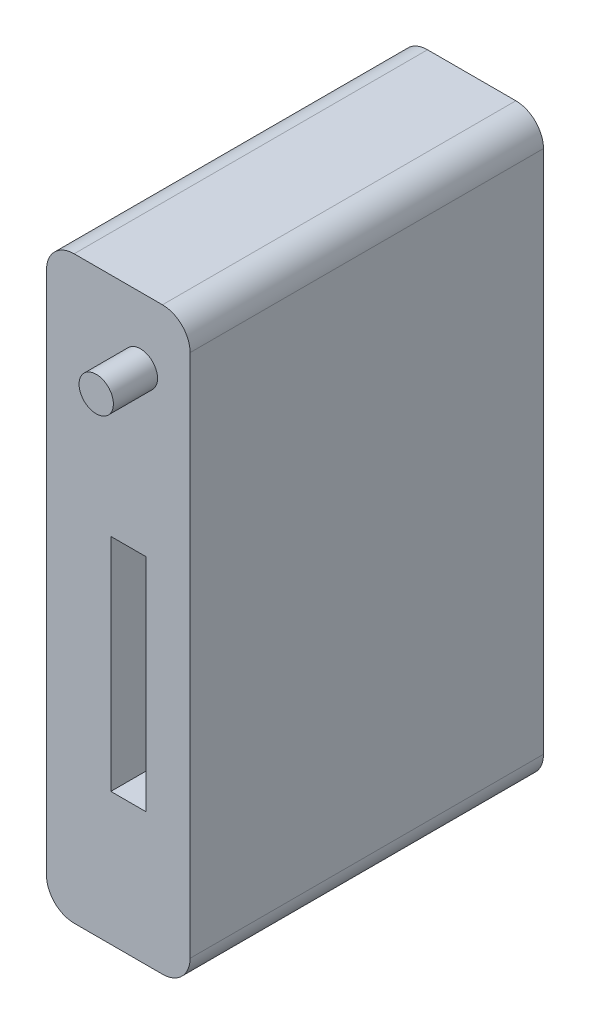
from build123d import *

# Parameters (mm, degrees)
BOSS_EXTRUDE1_DEPTH = 32
SKETCH2_W           = 6.35
SKETCH2_H           = 40
CUT_EXTRUDE1_DEPTH  = 7.62
SKETCH3_R           = 3.105
BOSS_EXTRUDE2_DEPTH = 8


with BuildPart() as part:
    # Sketch1 → Boss-Extrude1 (new, symmetric)
    with BuildSketch(Plane.XY):
        with BuildLine():
            Line((-8, -52.5), (8, -52.5))
            ThreePointArc((8, -52.5), (11.535533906, -51.035533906), (13, -47.5))
            Line((13, -47.5), (13, 47.5))
            ThreePointArc((13, 47.5), (11.535533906, 51.035533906), (8, 52.5))
            Line((8, 52.5), (-8, 52.5))
            ThreePointArc((-8, 52.5), (-11.535533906, 51.035533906), (-13, 47.5))
            Line((-13, 47.5), (-13, -47.5))
            ThreePointArc((-13, -47.5), (-11.535533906, -51.035533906), (-8, -52.5))
        make_face()
    extrude(amount=BOSS_EXTRUDE1_DEPTH, both=True)

    # Sketch2 → Cut-Extrude1 (cut)
    with BuildSketch(Plane.XY.offset(32)):
        with Locations((1.825, -8.5)):
            Rectangle(SKETCH2_W, SKETCH2_H)
    extrude(amount=-CUT_EXTRUDE1_DEPTH, mode=Mode.SUBTRACT)

    # Sketch3 → Boss-Extrude2 (add)
    with BuildSketch(Plane.XY.offset(32)):
        with Locations(Location((4, 40.5, 0), (0, 0, 180))):
            Circle(SKETCH3_R)
    extrude(amount=BOSS_EXTRUDE2_DEPTH)


solid = part.part
